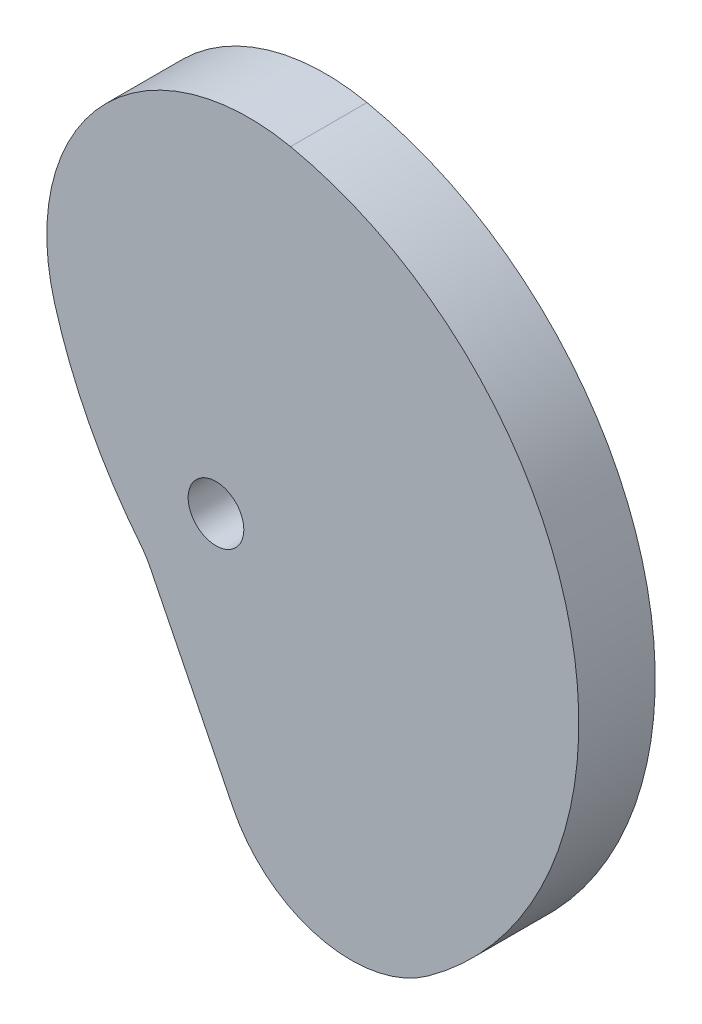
from build123d import *

# Parameters (mm, degrees)
ESQUISSE1_R      = 7.285971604
EXTRUSION1_DEPTH = 20


with BuildPart() as part:
    # Esquisse1 → Extrusion1 (new body)
    with BuildSketch(Plane.XY):
        with BuildLine():
            Line((-17.339261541, -20.604554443), (4.424682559, -64.376458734))
            ThreePointArc((4.424682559, -64.376458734), (27.066359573, -82.528973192), (55.556529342, -77.009050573))
            ThreePointArc((55.556529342, -77.009050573), (92.891515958, 19.699951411), (19.51669546, 92.930191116))
            ThreePointArc((19.51669546, 92.930191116), (-30.110826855, 77.180252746), (-42.226967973, 26.542809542))
            ThreePointArc((-42.226967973, 26.542809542), (-33.115511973, 3.657966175), (-19.661984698, -16.975436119))
            ThreePointArc((-19.661984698, -16.975436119), (-18.402618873, -18.727270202), (-17.339261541, -20.604554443))
        make_face()
        Circle(ESQUISSE1_R, mode=Mode.SUBTRACT)
    extrude(amount=EXTRUSION1_DEPTH)


solid = part.part
